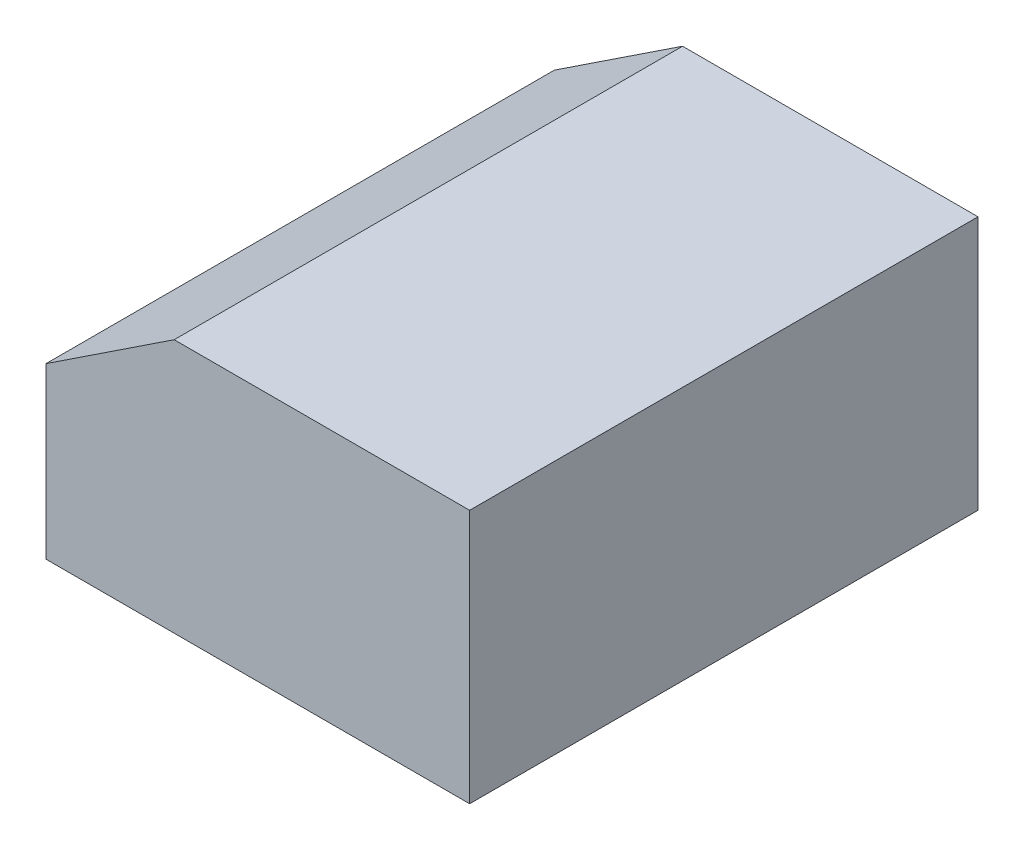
from build123d import *

# Parameters (mm, degrees)
EXTRUSION1_DEPTH = 30


with BuildPart() as part:
    # Esquisse1 → Extrusion1 (new body)
    with BuildSketch(Plane.XY):
        Polygon((0, 3.421879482), (25, 3.421879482), (25, 18.421879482), (7.565231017, 18.421879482), (0, 13.417188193), align=None)
    extrude(amount=EXTRUSION1_DEPTH)


solid = part.part
